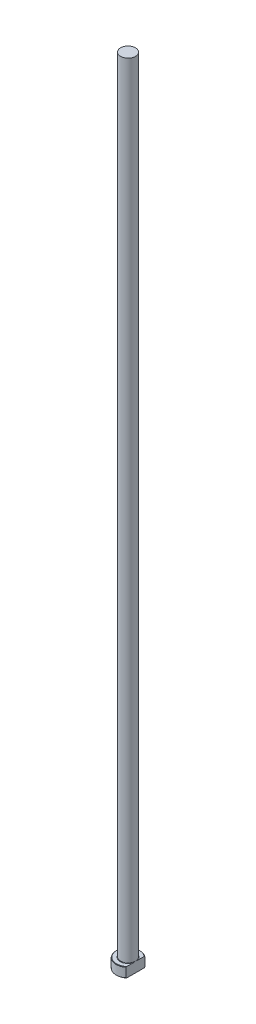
ISO-10303-21;
HEADER;
FILE_DESCRIPTION(('STEP AP214'),'2;1');
FILE_NAME('part.step','',(''),(''),'','','');
FILE_SCHEMA(('AUTOMOTIVE_DESIGN { 1 0 10303 214 1 1 1 1 }'));
ENDSEC;
DATA;
#1=APPLICATION_CONTEXT('core data for automotive mechanical design processes');
#2=APPLICATION_PROTOCOL_DEFINITION('international standard','automotive_design',2000,#1);
#3=PRODUCT_CONTEXT('',#1,'mechanical');
#4=PRODUCT('Part','Part','',(#3));
#5=PRODUCT_RELATED_PRODUCT_CATEGORY('part','',(#4));
#6=PRODUCT_DEFINITION_FORMATION('','',#4);
#7=PRODUCT_DEFINITION_CONTEXT('part definition',#1,'design');
#8=PRODUCT_DEFINITION('design','',#6,#7);
#9=PRODUCT_DEFINITION_SHAPE('','',#8);
#10=(LENGTH_UNIT() NAMED_UNIT(*) SI_UNIT(.MILLI.,.METRE.));
#11=(NAMED_UNIT(*) PLANE_ANGLE_UNIT() SI_UNIT($,.RADIAN.));
#12=(NAMED_UNIT(*) SI_UNIT($,.STERADIAN.) SOLID_ANGLE_UNIT());
#13=UNCERTAINTY_MEASURE_WITH_UNIT(LENGTH_MEASURE(1.E-05),#10,'distance_accuracy_value','');
#14=(GEOMETRIC_REPRESENTATION_CONTEXT(3) GLOBAL_UNCERTAINTY_ASSIGNED_CONTEXT((#13)) GLOBAL_UNIT_ASSIGNED_CONTEXT((#10,
#11,#12)) REPRESENTATION_CONTEXT('',''));
#15=CARTESIAN_POINT('',(0.,0.,0.));
#16=DIRECTION('',(0.,0.,1.));
#17=DIRECTION('',(1.,0.,0.));
#18=AXIS2_PLACEMENT_3D('',#15,#16,#17);
#19=CARTESIAN_POINT('',(0.,0.,0.));
#20=DIRECTION('',(0.,-1.,0.));
#21=DIRECTION('',(0.,0.,-1.));
#22=AXIS2_PLACEMENT_3D('',#19,#20,#21);
#23=PLANE('',#22);
#24=CARTESIAN_POINT('',(0.,0.,0.));
#25=DIRECTION('',(0.,-1.,0.));
#26=DIRECTION('',(0.,0.,-1.));
#27=AXIS2_PLACEMENT_3D('',#24,#25,#26);
#28=CIRCLE('',#27,5.79999999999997);
#29=CARTESIAN_POINT('',(3.74999999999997,0.,4.42464687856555));
#30=VERTEX_POINT('',#29);
#31=CARTESIAN_POINT('',(3.74999999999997,0.,-4.42464687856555));
#32=VERTEX_POINT('',#31);
#33=EDGE_CURVE('E98',#30,#32,#28,.T.);
#34=ORIENTED_EDGE('',*,*,#33,.T.);
#35=DIRECTION('',(0.,0.,1.));
#36=VECTOR('',#35,1.);
#37=CARTESIAN_POINT('',(3.74999999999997,0.,-4.68374849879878));
#38=LINE('',#37,#36);
#39=EDGE_CURVE('E83',#32,#30,#38,.T.);
#40=ORIENTED_EDGE('',*,*,#39,.T.);
#41=EDGE_LOOP('',(#34,#40));
#42=FACE_BOUND('',#41,.T.);
#43=ADVANCED_FACE('F32',(#42),#23,.T.);
#44=CARTESIAN_POINT('',(0.,259.958771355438,0.));
#45=DIRECTION('',(0.,1.,0.));
#46=DIRECTION('',(0.,0.,1.));
#47=AXIS2_PLACEMENT_3D('',#44,#45,#46);
#48=CYLINDRICAL_SURFACE('',#47,5.99999999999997);
#49=CARTESIAN_POINT('',(0.,4.80000000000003,0.));
#50=DIRECTION('',(0.,1.,0.));
#51=DIRECTION('',(0.,0.,1.));
#52=AXIS2_PLACEMENT_3D('',#49,#50,#51);
#53=CIRCLE('',#52,5.99999999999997);
#54=CARTESIAN_POINT('',(3.74999999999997,4.80000000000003,4.68374849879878));
#55=VERTEX_POINT('',#54);
#56=CARTESIAN_POINT('',(3.74999999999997,4.80000000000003,-4.68374849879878));
#57=VERTEX_POINT('',#56);
#58=EDGE_CURVE('E104',#55,#57,#53,.F.);
#59=ORIENTED_EDGE('',*,*,#58,.T.);
#60=DIRECTION('',(0.,-1.,0.));
#61=VECTOR('',#60,1.);
#62=CARTESIAN_POINT('',(3.74999999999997,400.,-4.68374849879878));
#63=LINE('',#62,#61);
#64=CARTESIAN_POINT('',(3.74999999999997,0.199999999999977,-4.68374849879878));
#65=VERTEX_POINT('',#64);
#66=EDGE_CURVE('E183',#57,#65,#63,.T.);
#67=ORIENTED_EDGE('',*,*,#66,.T.);
#68=CARTESIAN_POINT('',(0.,0.199999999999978,0.));
#69=DIRECTION('',(0.,-1.,0.));
#70=DIRECTION('',(0.,0.,-1.));
#71=AXIS2_PLACEMENT_3D('',#68,#69,#70);
#72=CIRCLE('',#71,5.99999999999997);
#73=CARTESIAN_POINT('',(3.74999999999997,0.199999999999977,4.68374849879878));
#74=VERTEX_POINT('',#73);
#75=EDGE_CURVE('E100',#65,#74,#72,.F.);
#76=ORIENTED_EDGE('',*,*,#75,.T.);
#77=DIRECTION('',(0.,-1.,0.));
#78=VECTOR('',#77,1.);
#79=CARTESIAN_POINT('',(3.74999999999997,400.,4.68374849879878));
#80=LINE('',#79,#78);
#81=EDGE_CURVE('E93',#55,#74,#80,.T.);
#82=ORIENTED_EDGE('',*,*,#81,.F.);
#83=EDGE_LOOP('',(#59,#67,#76,#82));
#84=FACE_BOUND('',#83,.T.);
#85=ADVANCED_FACE('F158',(#84),#48,.T.);
#86=CARTESIAN_POINT('',(-5.99999999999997,5.,0.));
#87=DIRECTION('',(0.,1.,0.));
#88=DIRECTION('',(0.,0.,1.));
#89=AXIS2_PLACEMENT_3D('',#86,#87,#88);
#90=PLANE('',#89);
#91=CARTESIAN_POINT('',(0.,5.,0.));
#92=DIRECTION('',(0.,1.,0.));
#93=DIRECTION('',(0.,0.,1.));
#94=AXIS2_PLACEMENT_3D('',#91,#92,#93);
#95=CIRCLE('',#94,5.79999999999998);
#96=CARTESIAN_POINT('',(3.74999999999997,5.,-4.42464687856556));
#97=VERTEX_POINT('',#96);
#98=CARTESIAN_POINT('',(3.74999999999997,5.,4.42464687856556));
#99=VERTEX_POINT('',#98);
#100=EDGE_CURVE('E178',#97,#99,#95,.T.);
#101=ORIENTED_EDGE('',*,*,#100,.T.);
#102=DIRECTION('',(0.,0.,-1.));
#103=VECTOR('',#102,1.);
#104=CARTESIAN_POINT('',(3.74999999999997,5.,0.));
#105=LINE('',#104,#103);
#106=CARTESIAN_POINT('',(3.74999999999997,4.99999999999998,1.24096736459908));
#107=VERTEX_POINT('',#106);
#108=EDGE_CURVE('E57',#99,#107,#105,.T.);
#109=ORIENTED_EDGE('',*,*,#108,.T.);
#110=CARTESIAN_POINT('',(0.,5.,0.));
#111=DIRECTION('',(0.,1.,0.));
#112=DIRECTION('',(0.,0.,1.));
#113=AXIS2_PLACEMENT_3D('',#110,#111,#112);
#114=CIRCLE('',#113,3.94999999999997);
#115=CARTESIAN_POINT('',(3.74999999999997,4.99999999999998,-1.24096736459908));
#116=VERTEX_POINT('',#115);
#117=EDGE_CURVE('E107',#107,#116,#114,.F.);
#118=ORIENTED_EDGE('',*,*,#117,.T.);
#119=EDGE_CURVE('E136',#116,#97,#105,.T.);
#120=ORIENTED_EDGE('',*,*,#119,.T.);
#121=EDGE_LOOP('',(#101,#109,#118,#120));
#122=FACE_BOUND('',#121,.T.);
#123=ADVANCED_FACE('F147',(#122),#90,.T.);
#124=CARTESIAN_POINT('',(0.,5.,0.));
#125=DIRECTION('',(0.,-1.,0.));
#126=DIRECTION('',(0.,0.,-1.));
#127=AXIS2_PLACEMENT_3D('',#124,#125,#126);
#128=CONICAL_SURFACE('',#127,5.79999999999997,0.785398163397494);
#129=ORIENTED_EDGE('',*,*,#58,.F.);
#130=CARTESIAN_POINT('',(3.74999999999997,-0.166791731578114,10.3057275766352));
#131=CARTESIAN_POINT('',(3.74999999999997,-0.014731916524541,10.1439111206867));
#132=CARTESIAN_POINT('',(3.74999999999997,0.137108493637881,9.9818885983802));
#133=CARTESIAN_POINT('',(3.74999999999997,0.440278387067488,9.65736450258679));
#134=CARTESIAN_POINT('',(3.74999999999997,0.591607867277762,9.49486292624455));
#135=CARTESIAN_POINT('',(3.74999999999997,1.044927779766,9.00631715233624));
#136=CARTESIAN_POINT('',(3.74999999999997,1.34603930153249,8.67945539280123));
#137=CARTESIAN_POINT('',(3.74999999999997,1.95254712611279,8.01460794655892));
#138=CARTESIAN_POINT('',(3.74999999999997,2.25786252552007,7.67654836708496));
#139=CARTESIAN_POINT('',(3.74999999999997,2.86353617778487,6.9963620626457));
#140=CARTESIAN_POINT('',(3.74999999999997,3.1638973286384,6.65423793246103));
#141=CARTESIAN_POINT('',(3.74999999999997,3.60894976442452,6.13647931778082));
#142=CARTESIAN_POINT('',(3.74999999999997,3.75634976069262,5.96317466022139));
#143=CARTESIAN_POINT('',(3.74999999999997,4.04886653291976,5.61465145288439));
#144=CARTESIAN_POINT('',(3.74999999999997,4.19398335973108,5.43943294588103));
#145=CARTESIAN_POINT('',(3.74999999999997,4.48160030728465,5.08627546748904));
#146=CARTESIAN_POINT('',(3.74999999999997,4.62409465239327,4.90833178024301));
#147=CARTESIAN_POINT('',(3.74999999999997,4.90527650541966,4.54947349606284));
#148=CARTESIAN_POINT('',(3.74999999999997,5.04396432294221,4.36855914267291));
#149=CARTESIAN_POINT('',(3.74999999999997,5.31490367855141,4.00479441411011));
#150=CARTESIAN_POINT('',(3.74999999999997,5.44720614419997,3.8219821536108));
#151=CARTESIAN_POINT('',(3.74999999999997,5.70510811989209,3.45154087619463));
#152=CARTESIAN_POINT('',(3.74999999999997,5.83070495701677,3.26390998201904));
#153=CARTESIAN_POINT('',(3.74999999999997,6.07201012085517,2.8832304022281));
#154=CARTESIAN_POINT('',(3.74999999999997,6.18775038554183,2.69020213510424));
#155=CARTESIAN_POINT('',(3.74999999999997,6.40563683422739,2.29668805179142));
#156=CARTESIAN_POINT('',(3.74999999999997,6.50779706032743,2.09621021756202));
#157=CARTESIAN_POINT('',(3.74999999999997,6.65161366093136,1.77679443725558));
#158=CARTESIAN_POINT('',(3.74999999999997,6.70007114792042,1.66092791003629));
#159=CARTESIAN_POINT('',(3.74999999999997,6.78940124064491,1.42624849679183));
#160=CARTESIAN_POINT('',(3.74999999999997,6.83027262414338,1.30743513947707));
#161=CARTESIAN_POINT('',(3.74999999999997,6.90263144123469,1.06768570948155));
#162=CARTESIAN_POINT('',(3.74999999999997,6.93417098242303,0.946765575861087));
#163=CARTESIAN_POINT('',(3.74999999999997,6.98660653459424,0.702615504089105));
#164=CARTESIAN_POINT('',(3.74999999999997,7.00750376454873,0.579385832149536));
#165=CARTESIAN_POINT('',(3.74999999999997,7.03759634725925,0.329742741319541));
#166=CARTESIAN_POINT('',(3.74999999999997,7.04662553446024,0.203308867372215));
#167=CARTESIAN_POINT('',(3.74999999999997,7.05180393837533,-0.0498149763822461));
#168=CARTESIAN_POINT('',(3.74999999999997,7.04795437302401,-0.176504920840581));
#169=CARTESIAN_POINT('',(3.74999999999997,7.02762041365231,-0.429279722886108));
#170=CARTESIAN_POINT('',(3.74999999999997,7.01109328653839,-0.555361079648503));
#171=CARTESIAN_POINT('',(3.74999999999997,6.96645264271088,-0.805449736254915));
#172=CARTESIAN_POINT('',(3.74999999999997,6.93833559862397,-0.929456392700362));
#173=CARTESIAN_POINT('',(3.74999999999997,6.86047960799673,-1.2176807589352));
#174=CARTESIAN_POINT('',(3.74999999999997,6.80661715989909,-1.38077734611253));
#175=CARTESIAN_POINT('',(3.74999999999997,6.68470595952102,-1.70153361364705));
#176=CARTESIAN_POINT('',(3.74999999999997,6.61664932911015,-1.85919021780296));
#177=CARTESIAN_POINT('',(3.74999999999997,6.46902362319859,-2.17116554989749));
#178=CARTESIAN_POINT('',(3.74999999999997,6.38933187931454,-2.32542554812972));
#179=CARTESIAN_POINT('',(3.74999999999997,6.26368569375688,-2.55336011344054));
#180=CARTESIAN_POINT('',(3.74999999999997,6.22079127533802,-2.62875319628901));
#181=CARTESIAN_POINT('',(3.74999999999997,6.13321972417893,-2.77849310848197));
#182=CARTESIAN_POINT('',(3.74999999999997,6.08854268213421,-2.85283999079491));
#183=CARTESIAN_POINT('',(3.74999999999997,5.93129752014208,-3.10843214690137));
#184=CARTESIAN_POINT('',(3.74999999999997,5.81483468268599,-3.28728416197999));
#185=CARTESIAN_POINT('',(3.74999999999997,5.57519396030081,-3.6404510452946));
#186=CARTESIAN_POINT('',(3.74999999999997,5.45201411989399,-3.81476457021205));
#187=CARTESIAN_POINT('',(3.74999999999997,5.20057170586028,-4.15993775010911));
#188=CARTESIAN_POINT('',(3.74999999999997,5.07230420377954,-4.3307938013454));
#189=CARTESIAN_POINT('',(3.74999999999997,4.81202699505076,-4.66958927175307));
#190=CARTESIAN_POINT('',(3.74999999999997,4.68001769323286,-4.83752900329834));
#191=CARTESIAN_POINT('',(3.74999999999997,4.41253585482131,-5.17177751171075));
#192=CARTESIAN_POINT('',(3.74999999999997,4.27705112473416,-5.3380765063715));
#193=CARTESIAN_POINT('',(3.74999999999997,4.0037688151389,-5.66876488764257));
#194=CARTESIAN_POINT('',(3.74999999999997,3.8659711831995,-5.83315423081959));
#195=CARTESIAN_POINT('',(3.74999999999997,3.44998502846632,-6.32380284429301));
#196=CARTESIAN_POINT('',(3.74999999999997,3.16904977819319,-6.64773216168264));
#197=CARTESIAN_POINT('',(3.74999999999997,2.63560043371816,-7.25347079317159));
#198=CARTESIAN_POINT('',(3.74999999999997,2.38362498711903,-7.53575743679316));
#199=CARTESIAN_POINT('',(3.74999999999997,1.8768348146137,-8.09784913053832));
#200=CARTESIAN_POINT('',(3.74999999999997,1.62201964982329,-8.3776537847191));
#201=CARTESIAN_POINT('',(3.74999999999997,1.11240843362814,-8.93303089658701));
#202=CARTESIAN_POINT('',(3.74999999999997,0.857629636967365,-9.20861921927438));
#203=CARTESIAN_POINT('',(3.74999999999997,0.346500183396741,-9.75823398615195));
#204=CARTESIAN_POINT('',(3.74999999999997,0.0901498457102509,-10.0322607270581));
#205=CARTESIAN_POINT('',(3.74999999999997,-0.166791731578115,-10.3057275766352));
#206=B_SPLINE_CURVE_WITH_KNOTS('',3,(#130,#131,#132,#133,#134,#135,#136,#137,#138,#139,#140,
#141,#142,#143,#144,#145,#146,#147,#148,#149,#150,#151,#152,#153,#154,#155,#156,#157,#158,#159,
#160,#161,#162,#163,#164,#165,#166,#167,#168,#169,#170,#171,#172,#173,#174,#175,#176,#177,#178,
#179,#180,#181,#182,#183,#184,#185,#186,#187,#188,#189,#190,#191,#192,#193,#194,#195,#196,#197,
#198,#199,#200,#201,#202,#203,#204,#205),.UNSPECIFIED.,.F.,.F.,(4,2,2,2,2,2,2,2,2,2,2,2,2,2,2,2,
2,2,2,2,2,2,2,2,2,2,2,2,2,2,2,2,2,2,2,2,2,4),(0.,0.666153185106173,1.33231034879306,
2.66554544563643,4.03209014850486,5.39780491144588,6.08032329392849,6.76282645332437,
7.44668645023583,8.13049065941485,8.80737551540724,9.48452819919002,10.1593958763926,
10.8335602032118,11.210125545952,11.586751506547,11.9612329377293,12.3356714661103,
12.7152985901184,13.0948898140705,13.4757662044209,13.8567585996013,14.3711324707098,
14.8857925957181,15.4063338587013,15.6665395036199,15.9267319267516,16.5667748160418,
17.2070050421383,17.8478713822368,18.4886686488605,19.1321508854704,19.7756477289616,
21.0619101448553,22.1970548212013,23.3323774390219,24.4583149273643,25.5840308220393),.UNSPECIFIED.);
#207=EDGE_CURVE('E135',#55,#99,#206,.T.);
#208=ORIENTED_EDGE('',*,*,#207,.T.);
#209=ORIENTED_EDGE('',*,*,#100,.F.);
#210=EDGE_CURVE('E127',#97,#57,#206,.T.);
#211=ORIENTED_EDGE('',*,*,#210,.T.);
#212=EDGE_LOOP('',(#129,#208,#209,#211));
#213=FACE_BOUND('',#212,.T.);
#214=ADVANCED_FACE('F143',(#213),#128,.T.);
#215=CARTESIAN_POINT('',(0.,0.199999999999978,0.));
#216=DIRECTION('',(0.,1.,0.));
#217=DIRECTION('',(0.,0.,1.));
#218=AXIS2_PLACEMENT_3D('',#215,#216,#217);
#219=CONICAL_SURFACE('',#218,5.99999999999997,0.785398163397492);
#220=ORIENTED_EDGE('',*,*,#75,.F.);
#221=CARTESIAN_POINT('',(3.74999999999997,5.16679173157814,-10.3057275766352));
#222=CARTESIAN_POINT('',(3.74999999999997,5.01473191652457,-10.1439111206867));
#223=CARTESIAN_POINT('',(3.74999999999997,4.86289150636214,-9.9818885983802));
#224=CARTESIAN_POINT('',(3.74999999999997,4.55972161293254,-9.65736450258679));
#225=CARTESIAN_POINT('',(3.74999999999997,4.40839213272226,-9.49486292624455));
#226=CARTESIAN_POINT('',(3.74999999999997,3.95507222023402,-9.00631715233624));
#227=CARTESIAN_POINT('',(3.74999999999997,3.65396069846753,-8.67945539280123));
#228=CARTESIAN_POINT('',(3.74999999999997,3.04745287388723,-8.01460794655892));
#229=CARTESIAN_POINT('',(3.74999999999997,2.74213747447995,-7.67654836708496));
#230=CARTESIAN_POINT('',(3.74999999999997,2.13646382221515,-6.9963620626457));
#231=CARTESIAN_POINT('',(3.74999999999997,1.83610267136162,-6.65423793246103));
#232=CARTESIAN_POINT('',(3.74999999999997,1.3910502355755,-6.13647931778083));
#233=CARTESIAN_POINT('',(3.74999999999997,1.2436502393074,-5.9631746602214));
#234=CARTESIAN_POINT('',(3.74999999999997,0.951133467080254,-5.6146514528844));
#235=CARTESIAN_POINT('',(3.74999999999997,0.806016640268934,-5.43943294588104));
#236=CARTESIAN_POINT('',(3.74999999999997,0.518399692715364,-5.08627546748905));
#237=CARTESIAN_POINT('',(3.74999999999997,0.375905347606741,-4.90833178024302));
#238=CARTESIAN_POINT('',(3.74999999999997,0.094723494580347,-4.54947349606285));
#239=CARTESIAN_POINT('',(3.74999999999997,-0.0439643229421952,-4.36855914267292));
#240=CARTESIAN_POINT('',(3.74999999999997,-0.314903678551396,-4.00479441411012));
#241=CARTESIAN_POINT('',(3.74999999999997,-0.447206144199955,-3.82198215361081));
#242=CARTESIAN_POINT('',(3.74999999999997,-0.705108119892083,-3.45154087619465));
#243=CARTESIAN_POINT('',(3.74999999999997,-0.830704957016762,-3.26390998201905));
#244=CARTESIAN_POINT('',(3.74999999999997,-1.07201012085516,-2.88323040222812));
#245=CARTESIAN_POINT('',(3.74999999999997,-1.18775038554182,-2.69020213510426));
#246=CARTESIAN_POINT('',(3.74999999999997,-1.40563683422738,-2.29668805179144));
#247=CARTESIAN_POINT('',(3.74999999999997,-1.50779706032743,-2.09621021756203));
#248=CARTESIAN_POINT('',(3.74999999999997,-1.65161366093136,-1.7767944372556));
#249=CARTESIAN_POINT('',(3.74999999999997,-1.70007114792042,-1.66092791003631));
#250=CARTESIAN_POINT('',(3.74999999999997,-1.7894012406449,-1.42624849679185));
#251=CARTESIAN_POINT('',(3.74999999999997,-1.83027262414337,-1.30743513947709));
#252=CARTESIAN_POINT('',(3.74999999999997,-1.90263144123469,-1.06768570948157));
#253=CARTESIAN_POINT('',(3.74999999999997,-1.93417098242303,-0.946765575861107));
#254=CARTESIAN_POINT('',(3.74999999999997,-1.98660653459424,-0.702615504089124));
#255=CARTESIAN_POINT('',(3.74999999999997,-2.00750376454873,-0.579385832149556));
#256=CARTESIAN_POINT('',(3.74999999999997,-2.03759634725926,-0.329742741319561));
#257=CARTESIAN_POINT('',(3.74999999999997,-2.04662553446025,-0.203308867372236));
#258=CARTESIAN_POINT('',(3.74999999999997,-2.05180393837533,0.049814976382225));
#259=CARTESIAN_POINT('',(3.74999999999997,-2.04795437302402,0.17650492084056));
#260=CARTESIAN_POINT('',(3.74999999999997,-2.02762041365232,0.429279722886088));
#261=CARTESIAN_POINT('',(3.74999999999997,-2.0110932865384,0.555361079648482));
#262=CARTESIAN_POINT('',(3.74999999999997,-1.96645264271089,0.805449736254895));
#263=CARTESIAN_POINT('',(3.74999999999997,-1.93833559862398,0.929456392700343));
#264=CARTESIAN_POINT('',(3.74999999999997,-1.86047960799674,1.21768075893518));
#265=CARTESIAN_POINT('',(3.74999999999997,-1.80661715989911,1.38077734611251));
#266=CARTESIAN_POINT('',(3.74999999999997,-1.68470595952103,1.70153361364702));
#267=CARTESIAN_POINT('',(3.74999999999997,-1.61664932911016,1.85919021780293));
#268=CARTESIAN_POINT('',(3.74999999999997,-1.46902362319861,2.17116554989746));
#269=CARTESIAN_POINT('',(3.74999999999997,-1.38933187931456,2.32542554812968));
#270=CARTESIAN_POINT('',(3.74999999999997,-1.2636856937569,2.5533601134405));
#271=CARTESIAN_POINT('',(3.74999999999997,-1.22079127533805,2.62875319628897));
#272=CARTESIAN_POINT('',(3.74999999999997,-1.13321972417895,2.77849310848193));
#273=CARTESIAN_POINT('',(3.74999999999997,-1.08854268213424,2.85283999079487));
#274=CARTESIAN_POINT('',(3.74999999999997,-0.931297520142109,3.10843214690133));
#275=CARTESIAN_POINT('',(3.74999999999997,-0.814834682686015,3.28728416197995));
#276=CARTESIAN_POINT('',(3.74999999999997,-0.575193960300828,3.64045104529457));
#277=CARTESIAN_POINT('',(3.74999999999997,-0.452014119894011,3.81476457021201));
#278=CARTESIAN_POINT('',(3.74999999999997,-0.200571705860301,4.15993775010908));
#279=CARTESIAN_POINT('',(3.74999999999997,-0.0723042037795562,4.33079380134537));
#280=CARTESIAN_POINT('',(3.74999999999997,0.187973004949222,4.66958927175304));
#281=CARTESIAN_POINT('',(3.74999999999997,0.319982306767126,4.83752900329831));
#282=CARTESIAN_POINT('',(3.74999999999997,0.587464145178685,5.17177751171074));
#283=CARTESIAN_POINT('',(3.74999999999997,0.722948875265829,5.33807650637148));
#284=CARTESIAN_POINT('',(3.74999999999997,0.996231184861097,5.66876488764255));
#285=CARTESIAN_POINT('',(3.74999999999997,1.1340288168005,5.83315423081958));
#286=CARTESIAN_POINT('',(3.74999999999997,1.55001497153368,6.323802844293));
#287=CARTESIAN_POINT('',(3.74999999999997,1.83095022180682,6.64773216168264));
#288=CARTESIAN_POINT('',(3.74999999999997,2.36439956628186,7.25347079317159));
#289=CARTESIAN_POINT('',(3.74999999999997,2.61637501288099,7.53575743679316));
#290=CARTESIAN_POINT('',(3.74999999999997,3.12316518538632,8.09784913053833));
#291=CARTESIAN_POINT('',(3.74999999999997,3.37798035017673,8.3776537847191));
#292=CARTESIAN_POINT('',(3.74999999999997,3.88759156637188,8.93303089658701));
#293=CARTESIAN_POINT('',(3.74999999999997,4.14237036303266,9.20861921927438));
#294=CARTESIAN_POINT('',(3.74999999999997,4.65349981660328,9.75823398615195));
#295=CARTESIAN_POINT('',(3.74999999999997,4.90985015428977,10.0322607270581));
#296=CARTESIAN_POINT('',(3.74999999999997,5.16679173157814,10.3057275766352));
#297=B_SPLINE_CURVE_WITH_KNOTS('',3,(#221,#222,#223,#224,#225,#226,#227,#228,#229,#230,#231,
#232,#233,#234,#235,#236,#237,#238,#239,#240,#241,#242,#243,#244,#245,#246,#247,#248,#249,#250,
#251,#252,#253,#254,#255,#256,#257,#258,#259,#260,#261,#262,#263,#264,#265,#266,#267,#268,#269,
#270,#271,#272,#273,#274,#275,#276,#277,#278,#279,#280,#281,#282,#283,#284,#285,#286,#287,#288,
#289,#290,#291,#292,#293,#294,#295,#296),.UNSPECIFIED.,.F.,.F.,(4,2,2,2,2,2,2,2,2,2,2,2,2,2,2,2,
2,2,2,2,2,2,2,2,2,2,2,2,2,2,2,2,2,2,2,2,2,4),(0.,0.666153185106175,1.33231034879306,
2.66554544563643,4.03209014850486,5.39780491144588,6.08032329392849,6.76282645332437,
7.44668645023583,8.13049065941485,8.80737551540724,9.48452819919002,10.1593958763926,
10.8335602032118,11.210125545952,11.586751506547,11.9612329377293,12.3356714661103,
12.7152985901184,13.0948898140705,13.4757662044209,13.8567585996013,14.3711324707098,
14.8857925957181,15.4063338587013,15.6665395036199,15.9267319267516,16.5667748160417,
17.2070050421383,17.8478713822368,18.4886686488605,19.1321508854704,19.7756477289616,
21.0619101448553,22.1970548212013,23.332377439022,24.4583149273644,25.5840308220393),.UNSPECIFIED.);
#298=EDGE_CURVE('E86',#65,#32,#297,.T.);
#299=ORIENTED_EDGE('',*,*,#298,.T.);
#300=ORIENTED_EDGE('',*,*,#33,.F.);
#301=EDGE_CURVE('E89',#30,#74,#297,.T.);
#302=ORIENTED_EDGE('',*,*,#301,.T.);
#303=EDGE_LOOP('',(#220,#299,#300,#302));
#304=FACE_BOUND('',#303,.T.);
#305=ADVANCED_FACE('F97',(#304),#219,.T.);
#306=CARTESIAN_POINT('',(0.,5.19999999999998,0.));
#307=DIRECTION('',(0.,1.,0.));
#308=DIRECTION('',(0.,0.,1.));
#309=AXIS2_PLACEMENT_3D('',#306,#307,#308);
#310=TOROIDAL_SURFACE('',#309,3.94999999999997,0.2);
#311=CARTESIAN_POINT('',(3.74999999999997,5.19999999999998,0.));
#312=CARTESIAN_POINT('',(3.74999999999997,5.20000051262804,-2.87877875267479E-10));
#313=CARTESIAN_POINT('',(3.74999999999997,5.2000010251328,-2.25357307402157E-07));
#314=CARTESIAN_POINT('',(3.74999999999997,5.20000197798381,-8.32474472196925E-07));
#315=CARTESIAN_POINT('',(3.74999999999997,5.20000240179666,-1.23037624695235E-06));
#316=CARTESIAN_POINT('',(3.74999999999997,5.20000329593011,-2.1874363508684E-06));
#317=CARTESIAN_POINT('',(3.74999999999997,5.20000375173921,-2.76211833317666E-06));
#318=CARTESIAN_POINT('',(3.74999999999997,5.20000455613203,-3.94274255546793E-06));
#319=CARTESIAN_POINT('',(3.74999999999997,5.20000490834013,-4.54644341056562E-06));
#320=CARTESIAN_POINT('',(3.74999999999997,5.20000624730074,-6.92466681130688E-06));
#321=CARTESIAN_POINT('',(3.74999999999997,5.20000716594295,-8.74076191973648E-06));
#322=CARTESIAN_POINT('',(3.74999999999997,5.20000864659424,-1.2305250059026E-05));
#323=CARTESIAN_POINT('',(3.74999999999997,5.20000923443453,-1.4043310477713E-05));
#324=CARTESIAN_POINT('',(3.74999999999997,5.20001175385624,-2.15092611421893E-05));
#325=CARTESIAN_POINT('',(3.74999999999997,5.20001367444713,-2.72432101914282E-05));
#326=CARTESIAN_POINT('',(3.74999999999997,5.20001644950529,-3.79951292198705E-05));
#327=CARTESIAN_POINT('',(3.74999999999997,5.20001742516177,-4.29814178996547E-05));
#328=CARTESIAN_POINT('',(3.74999999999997,5.20002460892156,-8.03310024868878E-05));
#329=CARTESIAN_POINT('',(3.74999999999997,5.20003015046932,-0.000112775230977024));
#330=CARTESIAN_POINT('',(3.74999999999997,5.20005437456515,-0.000241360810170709));
#331=CARTESIAN_POINT('',(3.74999999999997,5.20007738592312,-0.000336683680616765));
#332=CARTESIAN_POINT('',(3.74999999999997,5.2001672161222,-0.000714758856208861));
#333=CARTESIAN_POINT('',(3.74999999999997,5.20023131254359,-0.000997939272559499));
#334=CARTESIAN_POINT('',(3.74999999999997,5.20048834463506,-0.00212553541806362));
#335=CARTESIAN_POINT('',(3.74999999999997,5.20068473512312,-0.00296938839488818));
#336=CARTESIAN_POINT('',(3.74999999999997,5.20150889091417,-0.00651948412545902));
#337=CARTESIAN_POINT('',(3.74999999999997,5.20213227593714,-0.00922644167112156));
#338=CARTESIAN_POINT('',(3.74999999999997,5.21093696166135,-0.047449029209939));
#339=CARTESIAN_POINT('',(3.74999999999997,5.21914648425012,-0.0829604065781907));
#340=CARTESIAN_POINT('',(3.74999999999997,5.23634325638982,-0.157927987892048));
#341=CARTESIAN_POINT('',(3.74999999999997,5.24531641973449,-0.197387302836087));
#342=CARTESIAN_POINT('',(3.74999999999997,5.26041433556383,-0.264774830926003));
#343=CARTESIAN_POINT('',(3.74999999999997,5.26660221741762,-0.292688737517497));
#344=CARTESIAN_POINT('',(3.74999999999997,5.27863779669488,-0.347814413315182));
#345=CARTESIAN_POINT('',(3.74999999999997,5.28449016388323,-0.375025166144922));
#346=CARTESIAN_POINT('',(3.74999999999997,5.30189789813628,-0.457537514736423));
#347=CARTESIAN_POINT('',(3.74999999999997,5.31311990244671,-0.512910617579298));
#348=CARTESIAN_POINT('',(3.74999999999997,5.33435371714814,-0.624416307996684));
#349=CARTESIAN_POINT('',(3.74999999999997,5.34435351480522,-0.68055120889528));
#350=CARTESIAN_POINT('',(3.74999999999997,5.3633402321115,-0.798309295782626));
#351=CARTESIAN_POINT('',(3.74999999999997,5.37214919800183,-0.859962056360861));
#352=CARTESIAN_POINT('',(3.74999999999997,5.38667037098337,-0.983470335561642));
#353=CARTESIAN_POINT('',(3.74999999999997,5.39239104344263,-1.04532482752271));
#354=CARTESIAN_POINT('',(3.74999999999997,5.39944323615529,-1.16735704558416));
#355=CARTESIAN_POINT('',(3.74999999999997,5.40090877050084,-1.22752541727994));
#356=CARTESIAN_POINT('',(3.74999999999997,5.39872274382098,-1.31720401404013));
#357=CARTESIAN_POINT('',(3.74999999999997,5.39729193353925,-1.34676575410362));
#358=CARTESIAN_POINT('',(3.74999999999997,5.39265012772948,-1.40574048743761));
#359=CARTESIAN_POINT('',(3.74999999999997,5.38944021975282,-1.43515356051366));
#360=CARTESIAN_POINT('',(3.74999999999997,5.38068094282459,-1.49396538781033));
#361=CARTESIAN_POINT('',(3.74999999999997,5.37510711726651,-1.52336068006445));
#362=CARTESIAN_POINT('',(3.74999999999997,5.36076919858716,-1.58137061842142));
#363=CARTESIAN_POINT('',(3.74999999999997,5.35200919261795,-1.60998621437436));
#364=CARTESIAN_POINT('',(3.74999999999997,5.33238965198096,-1.65861686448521));
#365=CARTESIAN_POINT('',(3.74999999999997,5.32257316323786,-1.67901898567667));
#366=CARTESIAN_POINT('',(3.74999999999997,5.30467241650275,-1.70783277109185));
#367=CARTESIAN_POINT('',(3.74999999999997,5.29812945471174,-1.71718739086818));
#368=CARTESIAN_POINT('',(3.74999999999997,5.2837001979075,-1.73480018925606));
#369=CARTESIAN_POINT('',(3.74999999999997,5.27581911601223,-1.74306240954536));
#370=CARTESIAN_POINT('',(3.74999999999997,5.26261463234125,-1.75418373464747));
#371=CARTESIAN_POINT('',(3.74999999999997,5.25787681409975,-1.75773399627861));
#372=CARTESIAN_POINT('',(3.74999999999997,5.24794673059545,-1.76414289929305));
#373=CARTESIAN_POINT('',(3.74999999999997,5.24275459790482,-1.76700174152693));
#374=CARTESIAN_POINT('',(3.74999999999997,5.23188845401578,-1.77184194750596));
#375=CARTESIAN_POINT('',(3.74999999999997,5.22620925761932,-1.77381196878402));
#376=CARTESIAN_POINT('',(3.74999999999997,5.21457526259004,-1.77659633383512));
#377=CARTESIAN_POINT('',(3.74999999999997,5.20862098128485,-1.77741276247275));
#378=CARTESIAN_POINT('',(3.74999999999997,5.19743537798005,-1.77775957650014));
#379=CARTESIAN_POINT('',(3.74999999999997,5.19220837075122,-1.77744024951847));
#380=CARTESIAN_POINT('',(3.74999999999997,5.18189414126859,-1.7758778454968));
#381=CARTESIAN_POINT('',(3.74999999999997,5.17680701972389,-1.77463412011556));
#382=CARTESIAN_POINT('',(3.74999999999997,5.16595570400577,-1.7710259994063));
#383=CARTESIAN_POINT('',(3.74999999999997,5.16024847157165,-1.76849257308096));
#384=CARTESIAN_POINT('',(3.74999999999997,5.14931958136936,-1.76253978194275));
#385=CARTESIAN_POINT('',(3.74999999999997,5.14409879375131,-1.75911886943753));
#386=CARTESIAN_POINT('',(3.74999999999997,5.13137207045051,-1.74952862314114));
#387=CARTESIAN_POINT('',(3.74999999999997,5.12422146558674,-1.74289229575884));
#388=CARTESIAN_POINT('',(3.74999999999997,5.11098063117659,-1.72864029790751));
#389=CARTESIAN_POINT('',(3.74999999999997,5.1048935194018,-1.72102185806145));
#390=CARTESIAN_POINT('',(3.74999999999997,5.08827617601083,-1.69771313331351));
#391=CARTESIAN_POINT('',(3.74999999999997,5.07895354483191,-1.68117193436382));
#392=CARTESIAN_POINT('',(3.74999999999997,5.06261247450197,-1.64704828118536));
#393=CARTESIAN_POINT('',(3.74999999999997,5.05559655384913,-1.62946471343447));
#394=CARTESIAN_POINT('',(3.74999999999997,5.04053076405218,-1.58583200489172));
#395=CARTESIAN_POINT('',(3.74999999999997,5.03339137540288,-1.55947193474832));
#396=CARTESIAN_POINT('',(3.74999999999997,5.02157296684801,-1.50618793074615));
#397=CARTESIAN_POINT('',(3.74999999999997,5.01689927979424,-1.47926290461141));
#398=CARTESIAN_POINT('',(3.74999999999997,5.00936793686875,-1.42466530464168));
#399=CARTESIAN_POINT('',(3.74999999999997,5.00654501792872,-1.39698806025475));
#400=CARTESIAN_POINT('',(3.74999999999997,5.00244752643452,-1.34156614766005));
#401=CARTESIAN_POINT('',(3.74999999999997,5.00117081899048,-1.31382162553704));
#402=CARTESIAN_POINT('',(3.74999999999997,4.99934872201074,-1.2362264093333));
#403=CARTESIAN_POINT('',(3.74999999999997,5.00019255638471,-1.18634383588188));
#404=CARTESIAN_POINT('',(3.74999999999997,5.00481837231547,-1.08670490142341));
#405=CARTESIAN_POINT('',(3.74999999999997,5.00860250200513,-1.03694865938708));
#406=CARTESIAN_POINT('',(3.74999999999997,5.02331363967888,-0.887521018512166));
#407=CARTESIAN_POINT('',(3.74999999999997,5.03759480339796,-0.788187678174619));
#408=CARTESIAN_POINT('',(3.74999999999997,5.06960041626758,-0.600482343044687));
#409=CARTESIAN_POINT('',(3.74999999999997,5.08683046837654,-0.512017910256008));
#410=CARTESIAN_POINT('',(3.74999999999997,5.12342991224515,-0.336669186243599));
#411=CARTESIAN_POINT('',(3.74999999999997,5.14277046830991,-0.249778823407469));
#412=CARTESIAN_POINT('',(3.74999999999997,5.16735885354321,-0.141807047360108));
#413=CARTESIAN_POINT('',(3.74999999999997,5.17220802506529,-0.120630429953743));
#414=CARTESIAN_POINT('',(3.74999999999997,5.18059064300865,-0.0841346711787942));
#415=CARTESIAN_POINT('',(3.74999999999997,5.1841173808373,-0.0688139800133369));
#416=CARTESIAN_POINT('',(3.74999999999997,5.1908487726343,-0.0396407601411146));
#417=CARTESIAN_POINT('',(3.74999999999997,5.19405197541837,-0.0257879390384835));
#418=CARTESIAN_POINT('',(3.74999999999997,5.1978642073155,-0.00924234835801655));
#419=CARTESIAN_POINT('',(3.74999999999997,5.19848382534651,-0.00655125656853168));
#420=CARTESIAN_POINT('',(3.74999999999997,5.19930710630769,-0.00300474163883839));
#421=CARTESIAN_POINT('',(3.74999999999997,5.19950636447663,-0.00214860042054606));
#422=CARTESIAN_POINT('',(3.74999999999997,5.19976688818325,-0.00100569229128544));
#423=CARTESIAN_POINT('',(3.74999999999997,5.19983166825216,-0.000719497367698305));
#424=CARTESIAN_POINT('',(3.74999999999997,5.19992231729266,-0.000337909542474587));
#425=CARTESIAN_POINT('',(3.74999999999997,5.19994544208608,-0.000242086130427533));
#426=CARTESIAN_POINT('',(3.74999999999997,5.1999697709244,-0.00011292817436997));
#427=CARTESIAN_POINT('',(3.74999999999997,5.19997532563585,-8.04160223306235E-05));
#428=CARTESIAN_POINT('',(3.74999999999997,5.19998253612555,-4.29967852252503E-05));
#429=CARTESIAN_POINT('',(3.74999999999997,5.19998351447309,-3.80069370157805E-05));
#430=CARTESIAN_POINT('',(3.74999999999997,5.19998629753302,-2.72475249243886E-05));
#431=CARTESIAN_POINT('',(3.74999999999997,5.19998822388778,-2.15098292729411E-05));
#432=CARTESIAN_POINT('',(3.74999999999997,5.19999075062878,-1.40399367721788E-05));
#433=CARTESIAN_POINT('',(3.74999999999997,5.19999133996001,-1.23016119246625E-05));
#434=CARTESIAN_POINT('',(3.74999999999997,5.19999282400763,-8.73682092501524E-06));
#435=CARTESIAN_POINT('',(3.74999999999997,5.19999374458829,-6.92072367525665E-06));
#436=CARTESIAN_POINT('',(3.74999999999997,5.19999508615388,-4.54275759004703E-06));
#437=CARTESIAN_POINT('',(3.74999999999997,5.19999543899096,-3.93920665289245E-06));
#438=CARTESIAN_POINT('',(3.74999999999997,5.19999624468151,-2.7589957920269E-06));
#439=CARTESIAN_POINT('',(3.74999999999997,5.19999670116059,-2.18458256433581E-06));
#440=CARTESIAN_POINT('',(3.74999999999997,5.19999759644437,-1.22814421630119E-06));
#441=CARTESIAN_POINT('',(3.74999999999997,5.19999802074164,-8.30569674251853E-07));
#442=CARTESIAN_POINT('',(3.74999999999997,5.19999897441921,-2.24293963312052E-07));
#443=CARTESIAN_POINT('',(3.74999999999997,5.19999948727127,2.87934400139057E-10));
#444=CARTESIAN_POINT('',(3.74999999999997,5.19999999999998,0.));
#445=B_SPLINE_CURVE_WITH_KNOTS('',3,(#311,#312,#313,#314,#315,#316,#317,#318,#319,#320,#321,
#322,#323,#324,#325,#326,#327,#328,#329,#330,#331,#332,#333,#334,#335,#336,#337,#338,#339,#340,
#341,#342,#343,#344,#345,#346,#347,#348,#349,#350,#351,#352,#353,#354,#355,#356,#357,#358,#359,
#360,#361,#362,#363,#364,#365,#366,#367,#368,#369,#370,#371,#372,#373,#374,#375,#376,#377,#378,
#379,#380,#381,#382,#383,#384,#385,#386,#387,#388,#389,#390,#391,#392,#393,#394,#395,#396,#397,
#398,#399,#400,#401,#402,#403,#404,#405,#406,#407,#408,#409,#410,#411,#412,#413,#414,#415,#416,
#417,#418,#419,#420,#421,#422,#423,#424,#425,#426,#427,#428,#429,#430,#431,#432,#433,#434,#435,
#436,#437,#438,#439,#440,#441,#442,#443,#444),.UNSPECIFIED.,.T.,.F.,(4,2,2,2,2,2,2,2,2,2,2,2,2,
2,2,2,2,2,2,2,2,2,2,2,2,2,2,2,2,2,2,2,2,2,2,2,2,2,2,2,2,2,2,2,2,2,2,2,2,2,2,2,2,2,2,2,2,2,2,2,2,
2,2,2,2,2,4),(0.,1.56024700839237E-06,3.31164948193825E-06,5.49717735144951E-06,
7.59327506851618E-06,1.36787180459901E-05,1.91779081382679E-05,3.7292487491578E-05,
5.25176797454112E-05,0.000151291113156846,0.000445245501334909,0.00131651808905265,
0.00391543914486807,0.0122492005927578,0.121590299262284,0.242990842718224,0.328764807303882,
0.412263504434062,0.581748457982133,0.752784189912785,0.939563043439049,1.12582728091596,
1.30615794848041,1.3949070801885,1.48360201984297,1.57323786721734,1.66275913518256,
1.73030791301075,1.76447537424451,1.79851265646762,1.81622926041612,1.83394071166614,
1.85187219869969,1.86977123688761,1.885394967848,1.90102966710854,1.91965920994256,
1.9383214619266,1.9674229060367,1.99660828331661,2.05325108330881,2.10995552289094,
2.19168848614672,2.27359750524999,2.35700291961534,2.44029304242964,2.5898264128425,
2.7394691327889,3.04023923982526,3.31058675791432,3.57761795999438,3.64279234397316,
3.68995668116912,3.73261073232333,3.74089559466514,3.74353236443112,3.74441291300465,
3.74470840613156,3.74480738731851,3.74482262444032,3.74484075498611,3.74484625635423,
3.74485234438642,3.74485444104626,3.74485662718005,3.74485837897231,3.74485993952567),.UNSPECIFIED.);
#446=CARTESIAN_POINT('',(3.74999999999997,5.19999999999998,0.));
#447=VERTEX_POINT('',#446);
#448=EDGE_CURVE('E11',#116,#447,#445,.T.);
#449=ORIENTED_EDGE('',*,*,#448,.F.);
#450=ORIENTED_EDGE('',*,*,#117,.F.);
#451=CARTESIAN_POINT('',(3.74999999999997,5.19999999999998,0.));
#452=CARTESIAN_POINT('',(3.74999999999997,5.19999948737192,2.87877832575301E-10));
#453=CARTESIAN_POINT('',(3.74999999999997,5.19999897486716,2.25357307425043E-07));
#454=CARTESIAN_POINT('',(3.74999999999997,5.19999802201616,8.32474472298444E-07));
#455=CARTESIAN_POINT('',(3.74999999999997,5.1999975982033,1.23037624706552E-06));
#456=CARTESIAN_POINT('',(3.74999999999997,5.19999670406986,2.18743635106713E-06));
#457=CARTESIAN_POINT('',(3.74999999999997,5.19999624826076,2.76211833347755E-06));
#458=CARTESIAN_POINT('',(3.74999999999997,5.19999544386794,3.94274255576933E-06));
#459=CARTESIAN_POINT('',(3.74999999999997,5.19999509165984,4.54644341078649E-06));
#460=CARTESIAN_POINT('',(3.74999999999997,5.19999375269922,6.92466681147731E-06));
#461=CARTESIAN_POINT('',(3.74999999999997,5.19999283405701,8.74076191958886E-06));
#462=CARTESIAN_POINT('',(3.74999999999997,5.19999135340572,1.23052500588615E-05));
#463=CARTESIAN_POINT('',(3.74999999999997,5.19999076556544,1.40433104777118E-05));
#464=CARTESIAN_POINT('',(3.74999999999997,5.19998824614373,2.15092611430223E-05));
#465=CARTESIAN_POINT('',(3.74999999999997,5.19998632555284,2.72432101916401E-05));
#466=CARTESIAN_POINT('',(3.74999999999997,5.19998355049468,3.79951292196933E-05));
#467=CARTESIAN_POINT('',(3.74999999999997,5.1999825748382,4.29814178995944E-05));
#468=CARTESIAN_POINT('',(3.74999999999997,5.1999753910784,8.03310024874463E-05));
#469=CARTESIAN_POINT('',(3.74999999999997,5.19996984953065,0.000112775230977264));
#470=CARTESIAN_POINT('',(3.74999999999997,5.19994562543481,0.00024136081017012));
#471=CARTESIAN_POINT('',(3.74999999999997,5.19992261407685,0.000336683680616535));
#472=CARTESIAN_POINT('',(3.74999999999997,5.19983278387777,0.000714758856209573));
#473=CARTESIAN_POINT('',(3.74999999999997,5.19976868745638,0.00099793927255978));
#474=CARTESIAN_POINT('',(3.74999999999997,5.1995116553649,0.00212553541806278));
#475=CARTESIAN_POINT('',(3.74999999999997,5.19931526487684,0.00296938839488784));
#476=CARTESIAN_POINT('',(3.74999999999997,5.19849110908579,0.0065194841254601));
#477=CARTESIAN_POINT('',(3.74999999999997,5.19786772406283,0.00922644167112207));
#478=CARTESIAN_POINT('',(3.74999999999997,5.18906303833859,0.0474490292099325));
#479=CARTESIAN_POINT('',(3.74999999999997,5.18085351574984,0.0829604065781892));
#480=CARTESIAN_POINT('',(3.74999999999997,5.16365674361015,0.157927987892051));
#481=CARTESIAN_POINT('',(3.74999999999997,5.15468358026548,0.197387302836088));
#482=CARTESIAN_POINT('',(3.74999999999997,5.13958566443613,0.264774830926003));
#483=CARTESIAN_POINT('',(3.74999999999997,5.13339778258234,0.292688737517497));
#484=CARTESIAN_POINT('',(3.74999999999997,5.12136220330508,0.347814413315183));
#485=CARTESIAN_POINT('',(3.74999999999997,5.11550983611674,0.375025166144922));
#486=CARTESIAN_POINT('',(3.74999999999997,5.09810210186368,0.457537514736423));
#487=CARTESIAN_POINT('',(3.74999999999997,5.08688009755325,0.512910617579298));
#488=CARTESIAN_POINT('',(3.74999999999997,5.06564628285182,0.624416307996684));
#489=CARTESIAN_POINT('',(3.74999999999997,5.05564648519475,0.68055120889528));
#490=CARTESIAN_POINT('',(3.74999999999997,5.03665976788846,0.798309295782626));
#491=CARTESIAN_POINT('',(3.74999999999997,5.02785080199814,0.859962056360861));
#492=CARTESIAN_POINT('',(3.74999999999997,5.01332962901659,0.983470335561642));
#493=CARTESIAN_POINT('',(3.74999999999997,5.00760895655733,1.04532482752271));
#494=CARTESIAN_POINT('',(3.74999999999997,5.00055676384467,1.16735704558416));
#495=CARTESIAN_POINT('',(3.74999999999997,4.99909122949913,1.22752541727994));
#496=CARTESIAN_POINT('',(3.74999999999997,5.00127725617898,1.31720401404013));
#497=CARTESIAN_POINT('',(3.74999999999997,5.00270806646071,1.34676575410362));
#498=CARTESIAN_POINT('',(3.74999999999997,5.00734987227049,1.40574048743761));
#499=CARTESIAN_POINT('',(3.74999999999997,5.01055978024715,1.43515356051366));
#500=CARTESIAN_POINT('',(3.74999999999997,5.01931905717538,1.49396538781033));
#501=CARTESIAN_POINT('',(3.74999999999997,5.02489288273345,1.52336068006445));
#502=CARTESIAN_POINT('',(3.74999999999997,5.0392308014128,1.58137061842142));
#503=CARTESIAN_POINT('',(3.74999999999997,5.04799080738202,1.60998621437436));
#504=CARTESIAN_POINT('',(3.74999999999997,5.067610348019,1.65861686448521));
#505=CARTESIAN_POINT('',(3.74999999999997,5.07742683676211,1.67901898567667));
#506=CARTESIAN_POINT('',(3.74999999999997,5.09532758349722,1.70783277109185));
#507=CARTESIAN_POINT('',(3.74999999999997,5.10187054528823,1.71718739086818));
#508=CARTESIAN_POINT('',(3.74999999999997,5.11629980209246,1.73480018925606));
#509=CARTESIAN_POINT('',(3.74999999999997,5.12418088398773,1.74306240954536));
#510=CARTESIAN_POINT('',(3.74999999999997,5.13738536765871,1.75418373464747));
#511=CARTESIAN_POINT('',(3.74999999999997,5.14212318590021,1.75773399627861));
#512=CARTESIAN_POINT('',(3.74999999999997,5.15205326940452,1.76414289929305));
#513=CARTESIAN_POINT('',(3.74999999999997,5.15724540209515,1.76700174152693));
#514=CARTESIAN_POINT('',(3.74999999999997,5.16811154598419,1.77184194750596));
#515=CARTESIAN_POINT('',(3.74999999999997,5.17379074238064,1.77381196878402));
#516=CARTESIAN_POINT('',(3.74999999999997,5.18542473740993,1.77659633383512));
#517=CARTESIAN_POINT('',(3.74999999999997,5.19137901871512,1.77741276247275));
#518=CARTESIAN_POINT('',(3.74999999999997,5.20256462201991,1.77775957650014));
#519=CARTESIAN_POINT('',(3.74999999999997,5.20779162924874,1.77744024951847));
#520=CARTESIAN_POINT('',(3.74999999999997,5.21810585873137,1.7758778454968));
#521=CARTESIAN_POINT('',(3.74999999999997,5.22319298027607,1.77463412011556));
#522=CARTESIAN_POINT('',(3.74999999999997,5.2340442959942,1.7710259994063));
#523=CARTESIAN_POINT('',(3.74999999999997,5.23975152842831,1.76849257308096));
#524=CARTESIAN_POINT('',(3.74999999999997,5.2506804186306,1.76253978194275));
#525=CARTESIAN_POINT('',(3.74999999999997,5.25590120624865,1.75911886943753));
#526=CARTESIAN_POINT('',(3.74999999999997,5.26862792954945,1.74952862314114));
#527=CARTESIAN_POINT('',(3.74999999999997,5.27577853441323,1.74289229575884));
#528=CARTESIAN_POINT('',(3.74999999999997,5.28901936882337,1.72864029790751));
#529=CARTESIAN_POINT('',(3.74999999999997,5.29510648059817,1.72102185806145));
#530=CARTESIAN_POINT('',(3.74999999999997,5.31172382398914,1.69771313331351));
#531=CARTESIAN_POINT('',(3.74999999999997,5.32104645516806,1.68117193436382));
#532=CARTESIAN_POINT('',(3.74999999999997,5.33738752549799,1.64704828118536));
#533=CARTESIAN_POINT('',(3.74999999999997,5.34440344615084,1.62946471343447));
#534=CARTESIAN_POINT('',(3.74999999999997,5.35946923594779,1.58583200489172));
#535=CARTESIAN_POINT('',(3.74999999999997,5.36660862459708,1.55947193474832));
#536=CARTESIAN_POINT('',(3.74999999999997,5.37842703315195,1.50618793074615));
#537=CARTESIAN_POINT('',(3.74999999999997,5.38310072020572,1.47926290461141));
#538=CARTESIAN_POINT('',(3.74999999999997,5.39063206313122,1.42466530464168));
#539=CARTESIAN_POINT('',(3.74999999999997,5.39345498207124,1.39698806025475));
#540=CARTESIAN_POINT('',(3.74999999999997,5.39755247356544,1.34156614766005));
#541=CARTESIAN_POINT('',(3.74999999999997,5.39882918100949,1.31382162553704));
#542=CARTESIAN_POINT('',(3.74999999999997,5.40065127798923,1.2362264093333));
#543=CARTESIAN_POINT('',(3.74999999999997,5.39980744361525,1.18634383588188));
#544=CARTESIAN_POINT('',(3.74999999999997,5.39518162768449,1.08670490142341));
#545=CARTESIAN_POINT('',(3.74999999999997,5.39139749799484,1.03694865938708));
#546=CARTESIAN_POINT('',(3.74999999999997,5.37668636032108,0.887521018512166));
#547=CARTESIAN_POINT('',(3.74999999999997,5.362405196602,0.788187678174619));
#548=CARTESIAN_POINT('',(3.74999999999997,5.33039958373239,0.600482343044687));
#549=CARTESIAN_POINT('',(3.74999999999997,5.31316953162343,0.512017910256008));
#550=CARTESIAN_POINT('',(3.74999999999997,5.27657008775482,0.336669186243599));
#551=CARTESIAN_POINT('',(3.74999999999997,5.25722953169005,0.249778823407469));
#552=CARTESIAN_POINT('',(3.74999999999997,5.23264114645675,0.141807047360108));
#553=CARTESIAN_POINT('',(3.74999999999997,5.22779197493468,0.120630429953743));
#554=CARTESIAN_POINT('',(3.74999999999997,5.21940935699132,0.0841346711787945));
#555=CARTESIAN_POINT('',(3.74999999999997,5.21588261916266,0.0688139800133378));
#556=CARTESIAN_POINT('',(3.74999999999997,5.20915122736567,0.0396407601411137));
#557=CARTESIAN_POINT('',(3.74999999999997,5.20594802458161,0.0257879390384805));
#558=CARTESIAN_POINT('',(3.74999999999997,5.20213579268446,0.00924234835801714));
#559=CARTESIAN_POINT('',(3.74999999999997,5.20151617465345,0.00655125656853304));
#560=CARTESIAN_POINT('',(3.74999999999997,5.20069289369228,0.00300474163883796));
#561=CARTESIAN_POINT('',(3.74999999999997,5.20049363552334,0.00214860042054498));
#562=CARTESIAN_POINT('',(3.74999999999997,5.20023311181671,0.00100569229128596));
#563=CARTESIAN_POINT('',(3.74999999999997,5.2001683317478,0.000719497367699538));
#564=CARTESIAN_POINT('',(3.74999999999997,5.2000776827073,0.000337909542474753));
#565=CARTESIAN_POINT('',(3.74999999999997,5.20005455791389,0.000242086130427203));
#566=CARTESIAN_POINT('',(3.74999999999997,5.20003022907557,0.000112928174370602));
#567=CARTESIAN_POINT('',(3.74999999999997,5.20002467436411,8.04160223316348E-05));
#568=CARTESIAN_POINT('',(3.74999999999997,5.20001746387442,4.29967852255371E-05));
#569=CARTESIAN_POINT('',(3.74999999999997,5.20001648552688,3.80069370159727E-05));
#570=CARTESIAN_POINT('',(3.74999999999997,5.20001370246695,2.72475249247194E-05));
#571=CARTESIAN_POINT('',(3.74999999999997,5.20001177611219,2.15098292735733E-05));
#572=CARTESIAN_POINT('',(3.74999999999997,5.20000924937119,1.40399367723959E-05));
#573=CARTESIAN_POINT('',(3.74999999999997,5.20000866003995,1.23016119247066E-05));
#574=CARTESIAN_POINT('',(3.74999999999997,5.20000717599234,8.73682092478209E-06));
#575=CARTESIAN_POINT('',(3.74999999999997,5.20000625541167,6.92072367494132E-06));
#576=CARTESIAN_POINT('',(3.74999999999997,5.20000491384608,4.54275759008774E-06));
#577=CARTESIAN_POINT('',(3.74999999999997,5.20000456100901,3.93920665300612E-06));
#578=CARTESIAN_POINT('',(3.74999999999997,5.20000375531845,2.75899579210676E-06));
#579=CARTESIAN_POINT('',(3.74999999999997,5.20000329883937,2.18458256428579E-06));
#580=CARTESIAN_POINT('',(3.74999999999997,5.2000024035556,1.22814421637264E-06));
#581=CARTESIAN_POINT('',(3.74999999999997,5.20000197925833,8.30569674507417E-07));
#582=CARTESIAN_POINT('',(3.74999999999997,5.20000102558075,2.24293963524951E-07));
#583=CARTESIAN_POINT('',(3.74999999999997,5.2000005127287,-2.87934357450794E-10));
#584=CARTESIAN_POINT('',(3.74999999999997,5.19999999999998,0.));
#585=B_SPLINE_CURVE_WITH_KNOTS('',3,(#451,#452,#453,#454,#455,#456,#457,#458,#459,#460,#461,
#462,#463,#464,#465,#466,#467,#468,#469,#470,#471,#472,#473,#474,#475,#476,#477,#478,#479,#480,
#481,#482,#483,#484,#485,#486,#487,#488,#489,#490,#491,#492,#493,#494,#495,#496,#497,#498,#499,
#500,#501,#502,#503,#504,#505,#506,#507,#508,#509,#510,#511,#512,#513,#514,#515,#516,#517,#518,
#519,#520,#521,#522,#523,#524,#525,#526,#527,#528,#529,#530,#531,#532,#533,#534,#535,#536,#537,
#538,#539,#540,#541,#542,#543,#544,#545,#546,#547,#548,#549,#550,#551,#552,#553,#554,#555,#556,
#557,#558,#559,#560,#561,#562,#563,#564,#565,#566,#567,#568,#569,#570,#571,#572,#573,#574,#575,
#576,#577,#578,#579,#580,#581,#582,#583,#584),.UNSPECIFIED.,.T.,.F.,(4,2,2,2,2,2,2,2,2,2,2,2,2,
2,2,2,2,2,2,2,2,2,2,2,2,2,2,2,2,2,2,2,2,2,2,2,2,2,2,2,2,2,2,2,2,2,2,2,2,2,2,2,2,2,2,2,2,2,2,2,2,
2,2,2,2,2,4),(0.,1.5602470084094E-06,3.31164948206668E-06,5.49717735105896E-06,
7.59327506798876E-06,1.36787180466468E-05,1.9177908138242E-05,3.72924874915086E-05,
5.25176797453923E-05,0.000151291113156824,0.000445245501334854,0.00131651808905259,
0.00391543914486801,0.0122492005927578,0.121590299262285,0.242990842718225,0.328764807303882,
0.412263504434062,0.581748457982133,0.752784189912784,0.939563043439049,1.12582728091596,
1.30615794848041,1.3949070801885,1.48360201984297,1.57323786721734,1.66275913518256,
1.73030791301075,1.76447537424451,1.79851265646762,1.81622926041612,1.83394071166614,
1.85187219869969,1.86977123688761,1.885394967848,1.90102966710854,1.91965920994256,
1.9383214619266,1.9674229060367,1.99660828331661,2.05325108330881,2.10995552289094,
2.19168848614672,2.27359750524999,2.35700291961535,2.44029304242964,2.5898264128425,
2.7394691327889,3.04023923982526,3.31058675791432,3.57761795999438,3.64279234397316,
3.68995668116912,3.73261073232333,3.74089559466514,3.74353236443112,3.74441291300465,
3.74470840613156,3.74480738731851,3.74482262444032,3.74484075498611,3.74484625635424,
3.74485234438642,3.74485444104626,3.74485662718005,3.74485837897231,3.74485993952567),.UNSPECIFIED.);
#586=EDGE_CURVE('E46',#447,#107,#585,.T.);
#587=ORIENTED_EDGE('',*,*,#586,.F.);
#588=CARTESIAN_POINT('',(0.,5.19999999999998,0.));
#589=DIRECTION('',(0.,1.,0.));
#590=DIRECTION('',(0.,0.,1.));
#591=AXIS2_PLACEMENT_3D('',#588,#589,#590);
#592=CIRCLE('',#591,3.74999999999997);
#593=EDGE_CURVE('E103',#447,#447,#592,.T.);
#594=ORIENTED_EDGE('',*,*,#593,.F.);
#595=EDGE_LOOP('',(#449,#450,#587,#594));
#596=FACE_BOUND('',#595,.T.);
#597=ADVANCED_FACE('F34',(#596),#310,.F.);
#598=CARTESIAN_POINT('',(0.,259.958771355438,0.));
#599=DIRECTION('',(0.,1.,0.));
#600=DIRECTION('',(0.,0.,1.));
#601=AXIS2_PLACEMENT_3D('',#598,#599,#600);
#602=CYLINDRICAL_SURFACE('',#601,3.74999999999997);
#603=ORIENTED_EDGE('',*,*,#593,.T.);
#604=EDGE_LOOP('',(#603));
#605=FACE_BOUND('',#604,.T.);
#606=CARTESIAN_POINT('',(0.,400.,0.));
#607=DIRECTION('',(0.,1.,0.));
#608=DIRECTION('',(0.,0.,1.));
#609=AXIS2_PLACEMENT_3D('',#606,#607,#608);
#610=CIRCLE('',#609,3.74999999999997);
#611=CARTESIAN_POINT('',(0.,400.,3.74999999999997));
#612=VERTEX_POINT('',#611);
#613=EDGE_CURVE('E101',#612,#612,#610,.T.);
#614=ORIENTED_EDGE('',*,*,#613,.F.);
#615=EDGE_LOOP('',(#614));
#616=FACE_BOUND('',#615,.T.);
#617=ADVANCED_FACE('F155',(#605,#616),#602,.T.);
#618=CARTESIAN_POINT('',(-3.74999999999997,400.,0.));
#619=DIRECTION('',(0.,1.,0.));
#620=DIRECTION('',(0.,0.,1.));
#621=AXIS2_PLACEMENT_3D('',#618,#619,#620);
#622=PLANE('',#621);
#623=ORIENTED_EDGE('',*,*,#613,.T.);
#624=EDGE_LOOP('',(#623));
#625=FACE_BOUND('',#624,.T.);
#626=ADVANCED_FACE('F121',(#625),#622,.T.);
#627=CARTESIAN_POINT('',(3.74999999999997,400.,-4.68374849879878));
#628=DIRECTION('',(1.,0.,0.));
#629=DIRECTION('',(0.,0.,-1.));
#630=AXIS2_PLACEMENT_3D('',#627,#628,#629);
#631=PLANE('',#630);
#632=ORIENTED_EDGE('',*,*,#66,.F.);
#633=ORIENTED_EDGE('',*,*,#210,.F.);
#634=ORIENTED_EDGE('',*,*,#119,.F.);
#635=ORIENTED_EDGE('',*,*,#448,.T.);
#636=ORIENTED_EDGE('',*,*,#586,.T.);
#637=ORIENTED_EDGE('',*,*,#108,.F.);
#638=ORIENTED_EDGE('',*,*,#207,.F.);
#639=ORIENTED_EDGE('',*,*,#81,.T.);
#640=ORIENTED_EDGE('',*,*,#301,.F.);
#641=ORIENTED_EDGE('',*,*,#39,.F.);
#642=ORIENTED_EDGE('',*,*,#298,.F.);
#643=EDGE_LOOP('',(#632,#633,#634,#635,#636,#637,#638,#639,#640,#641,#642));
#644=FACE_BOUND('',#643,.T.);
#645=ADVANCED_FACE('F85',(#644),#631,.T.);
#646=CLOSED_SHELL('',(#43,#85,#123,#214,#305,#597,#617,#626,#645));
#647=MANIFOLD_SOLID_BREP('B2',#646);
#648=ADVANCED_BREP_SHAPE_REPRESENTATION('',(#18,#647),#14);
#649=SHAPE_DEFINITION_REPRESENTATION(#9,#648);
ENDSEC;
END-ISO-10303-21;
